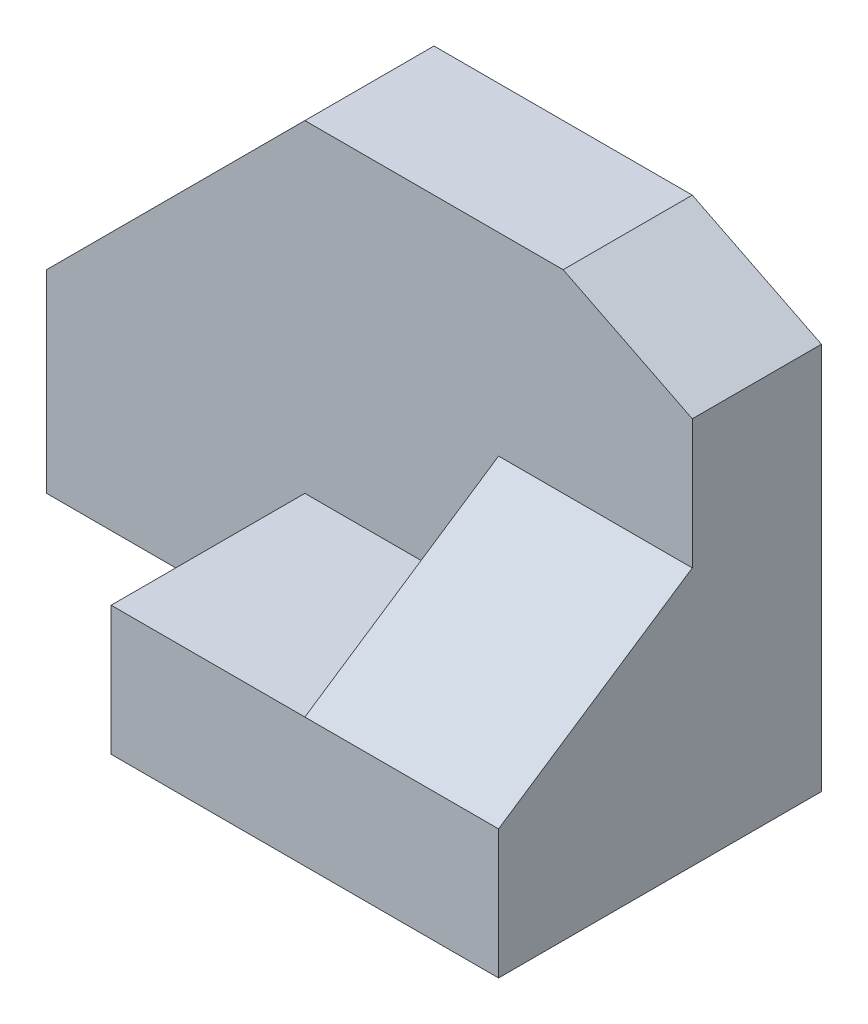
from build123d import *

# Parameters (mm, degrees)
CROQUIS1_W              = 100
CROQUIS1_H              = 70
SALIENTE_EXTRUIR1_DEPTH = 25
CORTAR_EXTRUIR9_DEPTH   = 79.89866919
CROQUIS12_W             = 30
CROQUIS12_H             = 70
CORTAR_EXTRUIR10_DEPTH  = 40
CROQUIS13_W             = 30
CROQUIS13_H             = 50
CORTAR_EXTRUIR11_DEPTH  = 30
CORTAR_EXTRUIR12_DEPTH  = 83.158383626


with BuildPart() as part:
    # Croquis1 → Saliente-Extruir1 (new, symmetric)
    with BuildSketch(Plane.XY):
        Rectangle(CROQUIS1_W, CROQUIS1_H)
    extrude(amount=SALIENTE_EXTRUIR1_DEPTH, both=True)

    # Croquis11 → Cortar-Extruir9 (cut, through all)
    with BuildSketch(Plane.XY.offset(25)):
        Polygon((-50, -5), (-10, 35), (-50, 35), align=None)
        Polygon((30, 35), (50, 25), (50, 35), align=None)
    extrude(amount=-CORTAR_EXTRUIR9_DEPTH, mode=Mode.SUBTRACT)

    # Croquis12 → Cortar-Extruir10 (cut)
    with BuildSketch(Plane.ZY.offset(50)):
        with Locations((10, 0)):
            Rectangle(CROQUIS12_W, CROQUIS12_H)
    extrude(amount=-CORTAR_EXTRUIR10_DEPTH, mode=Mode.SUBTRACT)

    # Croquis13 → Cortar-Extruir11 (cut)
    with BuildSketch(Plane.ZY.offset(10)):
        with Locations((10, 10)):
            Rectangle(CROQUIS13_W, CROQUIS13_H)
    extrude(amount=-CORTAR_EXTRUIR11_DEPTH, mode=Mode.SUBTRACT)

    # Croquis14 → Cortar-Extruir12 (cut, through all)
    with BuildSketch(Plane.ZY.offset(-20)):
        Polygon((25, -15), (-5, 5), (-5, 35), (25, 35), align=None)
    extrude(amount=-CORTAR_EXTRUIR12_DEPTH, mode=Mode.SUBTRACT)


solid = part.part
